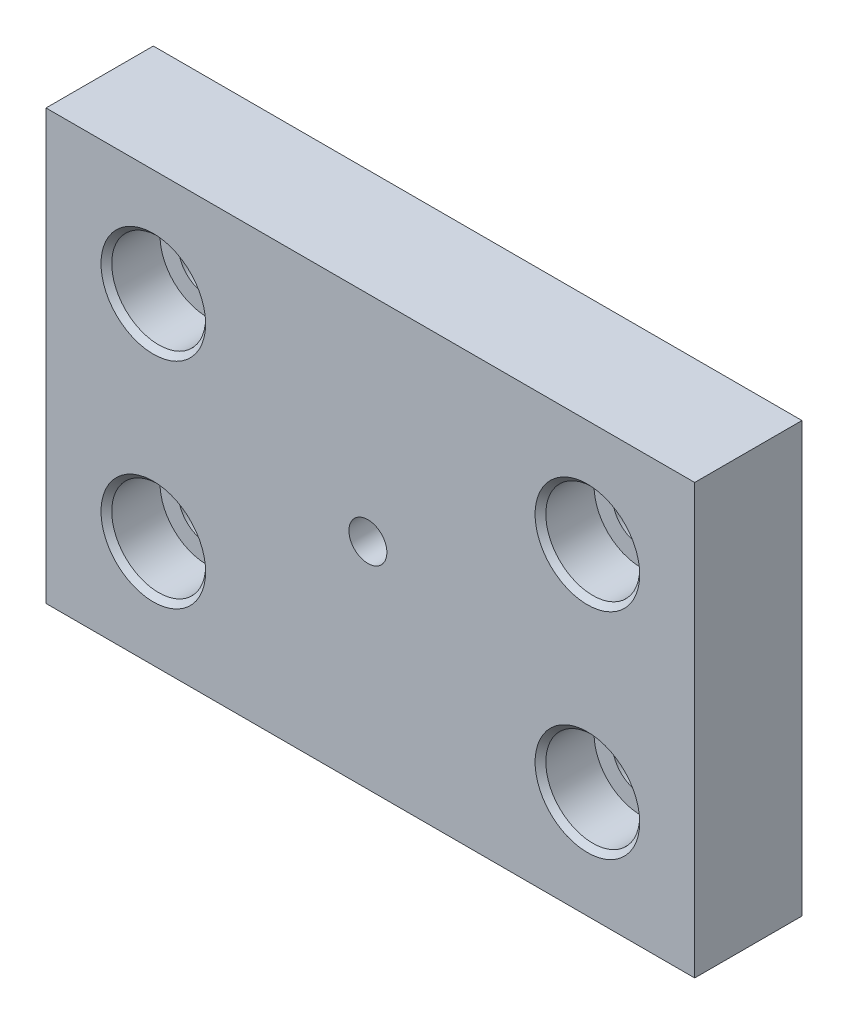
ISO-10303-21;
HEADER;
FILE_DESCRIPTION(('STEP AP214'),'2;1');
FILE_NAME('part.step','',(''),(''),'','','');
FILE_SCHEMA(('AUTOMOTIVE_DESIGN { 1 0 10303 214 1 1 1 1 }'));
ENDSEC;
DATA;
#1=APPLICATION_CONTEXT('core data for automotive mechanical design processes');
#2=APPLICATION_PROTOCOL_DEFINITION('international standard','automotive_design',2000,#1);
#3=PRODUCT_CONTEXT('',#1,'mechanical');
#4=PRODUCT('Part','Part','',(#3));
#5=PRODUCT_RELATED_PRODUCT_CATEGORY('part','',(#4));
#6=PRODUCT_DEFINITION_FORMATION('','',#4);
#7=PRODUCT_DEFINITION_CONTEXT('part definition',#1,'design');
#8=PRODUCT_DEFINITION('design','',#6,#7);
#9=PRODUCT_DEFINITION_SHAPE('','',#8);
#10=(LENGTH_UNIT() NAMED_UNIT(*) SI_UNIT(.MILLI.,.METRE.));
#11=(NAMED_UNIT(*) PLANE_ANGLE_UNIT() SI_UNIT($,.RADIAN.));
#12=(NAMED_UNIT(*) SI_UNIT($,.STERADIAN.) SOLID_ANGLE_UNIT());
#13=UNCERTAINTY_MEASURE_WITH_UNIT(LENGTH_MEASURE(1.E-05),#10,'distance_accuracy_value','');
#14=(GEOMETRIC_REPRESENTATION_CONTEXT(3) GLOBAL_UNCERTAINTY_ASSIGNED_CONTEXT((#13)) GLOBAL_UNIT_ASSIGNED_CONTEXT((#10,
#11,#12)) REPRESENTATION_CONTEXT('',''));
#15=CARTESIAN_POINT('',(0.,0.,0.));
#16=DIRECTION('',(0.,0.,1.));
#17=DIRECTION('',(1.,0.,0.));
#18=AXIS2_PLACEMENT_3D('',#15,#16,#17);
#19=CARTESIAN_POINT('',(-57.2202583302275,29.3904054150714,12.7));
#20=DIRECTION('',(1.,0.,0.));
#21=DIRECTION('',(0.,1.,0.));
#22=AXIS2_PLACEMENT_3D('',#19,#20,#21);
#23=PLANE('',#22);
#24=DIRECTION('',(0.,-1.,0.));
#25=VECTOR('',#24,1.);
#26=CARTESIAN_POINT('',(-57.2202583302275,29.3904054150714,0.));
#27=LINE('',#26,#25);
#28=CARTESIAN_POINT('',(-57.2202583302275,29.3904054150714,0.));
#29=VERTEX_POINT('',#28);
#30=CARTESIAN_POINT('',(-57.2202583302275,-21.4095945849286,0.));
#31=VERTEX_POINT('',#30);
#32=EDGE_CURVE('E109',#29,#31,#27,.T.);
#33=ORIENTED_EDGE('',*,*,#32,.T.);
#34=DIRECTION('',(0.,0.,-1.));
#35=VECTOR('',#34,1.);
#36=CARTESIAN_POINT('',(-57.2202583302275,-21.4095945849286,12.7));
#37=LINE('',#36,#35);
#38=CARTESIAN_POINT('',(-57.2202583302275,-21.4095945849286,12.7));
#39=VERTEX_POINT('',#38);
#40=EDGE_CURVE('E11',#39,#31,#37,.T.);
#41=ORIENTED_EDGE('',*,*,#40,.F.);
#42=DIRECTION('',(0.,-1.,0.));
#43=VECTOR('',#42,1.);
#44=CARTESIAN_POINT('',(-57.2202583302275,29.3904054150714,12.7));
#45=LINE('',#44,#43);
#46=CARTESIAN_POINT('',(-57.2202583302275,29.3904054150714,12.7));
#47=VERTEX_POINT('',#46);
#48=EDGE_CURVE('E92',#47,#39,#45,.T.);
#49=ORIENTED_EDGE('',*,*,#48,.F.);
#50=DIRECTION('',(0.,0.,-1.));
#51=VECTOR('',#50,1.);
#52=CARTESIAN_POINT('',(-57.2202583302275,29.3904054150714,12.7));
#53=LINE('',#52,#51);
#54=EDGE_CURVE('E105',#47,#29,#53,.T.);
#55=ORIENTED_EDGE('',*,*,#54,.T.);
#56=EDGE_LOOP('',(#33,#41,#49,#55));
#57=FACE_BOUND('',#56,.T.);
#58=ADVANCED_FACE('F40',(#57),#23,.F.);
#59=CARTESIAN_POINT('',(-57.2202583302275,-21.4095945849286,12.7));
#60=DIRECTION('',(0.,1.,0.));
#61=DIRECTION('',(0.,0.,1.));
#62=AXIS2_PLACEMENT_3D('',#59,#60,#61);
#63=PLANE('',#62);
#64=DIRECTION('',(1.,0.,0.));
#65=VECTOR('',#64,1.);
#66=CARTESIAN_POINT('',(-57.2202583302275,-21.4095945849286,0.));
#67=LINE('',#66,#65);
#68=CARTESIAN_POINT('',(19.5629091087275,-21.4095945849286,0.));
#69=VERTEX_POINT('',#68);
#70=EDGE_CURVE('E97',#31,#69,#67,.T.);
#71=ORIENTED_EDGE('',*,*,#70,.T.);
#72=DIRECTION('',(0.,0.,-1.));
#73=VECTOR('',#72,1.);
#74=CARTESIAN_POINT('',(19.5629091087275,-21.4095945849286,12.7));
#75=LINE('',#74,#73);
#76=CARTESIAN_POINT('',(19.5629091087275,-21.4095945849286,12.7));
#77=VERTEX_POINT('',#76);
#78=EDGE_CURVE('E49',#77,#69,#75,.T.);
#79=ORIENTED_EDGE('',*,*,#78,.F.);
#80=DIRECTION('',(1.,0.,0.));
#81=VECTOR('',#80,1.);
#82=CARTESIAN_POINT('',(-57.2202583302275,-21.4095945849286,12.7));
#83=LINE('',#82,#81);
#84=EDGE_CURVE('E87',#39,#77,#83,.T.);
#85=ORIENTED_EDGE('',*,*,#84,.F.);
#86=ORIENTED_EDGE('',*,*,#40,.T.);
#87=EDGE_LOOP('',(#71,#79,#85,#86));
#88=FACE_BOUND('',#87,.T.);
#89=ADVANCED_FACE('F96',(#88),#63,.F.);
#90=CARTESIAN_POINT('',(19.5629091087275,29.3904054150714,12.7));
#91=DIRECTION('',(-1.,0.,0.));
#92=DIRECTION('',(0.,-1.,0.));
#93=AXIS2_PLACEMENT_3D('',#90,#91,#92);
#94=PLANE('',#93);
#95=DIRECTION('',(0.,1.,0.));
#96=VECTOR('',#95,1.);
#97=CARTESIAN_POINT('',(19.5629091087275,29.3904054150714,0.));
#98=LINE('',#97,#96);
#99=CARTESIAN_POINT('',(19.5629091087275,29.3904054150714,0.));
#100=VERTEX_POINT('',#99);
#101=EDGE_CURVE('E74',#69,#100,#98,.T.);
#102=ORIENTED_EDGE('',*,*,#101,.T.);
#103=DIRECTION('',(0.,0.,-1.));
#104=VECTOR('',#103,1.);
#105=CARTESIAN_POINT('',(19.5629091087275,29.3904054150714,12.7));
#106=LINE('',#105,#104);
#107=CARTESIAN_POINT('',(19.5629091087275,29.3904054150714,12.7));
#108=VERTEX_POINT('',#107);
#109=EDGE_CURVE('E99',#108,#100,#106,.T.);
#110=ORIENTED_EDGE('',*,*,#109,.F.);
#111=DIRECTION('',(0.,1.,0.));
#112=VECTOR('',#111,1.);
#113=CARTESIAN_POINT('',(19.5629091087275,29.3904054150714,12.7));
#114=LINE('',#113,#112);
#115=EDGE_CURVE('E90',#77,#108,#114,.T.);
#116=ORIENTED_EDGE('',*,*,#115,.F.);
#117=ORIENTED_EDGE('',*,*,#78,.T.);
#118=EDGE_LOOP('',(#102,#110,#116,#117));
#119=FACE_BOUND('',#118,.T.);
#120=ADVANCED_FACE('F100',(#119),#94,.F.);
#121=CARTESIAN_POINT('',(-57.2202583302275,29.3904054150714,12.7));
#122=DIRECTION('',(0.,-1.,0.));
#123=DIRECTION('',(0.,0.,-1.));
#124=AXIS2_PLACEMENT_3D('',#121,#122,#123);
#125=PLANE('',#124);
#126=DIRECTION('',(-1.,0.,0.));
#127=VECTOR('',#126,1.);
#128=CARTESIAN_POINT('',(-57.2202583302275,29.3904054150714,0.));
#129=LINE('',#128,#127);
#130=EDGE_CURVE('E80',#100,#29,#129,.T.);
#131=ORIENTED_EDGE('',*,*,#130,.T.);
#132=ORIENTED_EDGE('',*,*,#54,.F.);
#133=DIRECTION('',(-1.,0.,0.));
#134=VECTOR('',#133,1.);
#135=CARTESIAN_POINT('',(-57.2202583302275,29.3904054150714,12.7));
#136=LINE('',#135,#134);
#137=EDGE_CURVE('E57',#108,#47,#136,.T.);
#138=ORIENTED_EDGE('',*,*,#137,.F.);
#139=ORIENTED_EDGE('',*,*,#109,.T.);
#140=EDGE_LOOP('',(#131,#132,#138,#139));
#141=FACE_BOUND('',#140,.T.);
#142=ADVANCED_FACE('F124',(#141),#125,.F.);
#143=CARTESIAN_POINT('',(0.,0.,12.7));
#144=DIRECTION('',(0.,0.,1.));
#145=DIRECTION('',(1.,0.,0.));
#146=AXIS2_PLACEMENT_3D('',#143,#144,#145);
#147=PLANE('',#146);
#148=CARTESIAN_POINT('',(-19.1202583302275,3.9904054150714,12.7));
#149=DIRECTION('',(0.,0.,-1.));
#150=DIRECTION('',(-1.,0.,0.));
#151=AXIS2_PLACEMENT_3D('',#148,#149,#150);
#152=CIRCLE('',#151,2.2479);
#153=CARTESIAN_POINT('',(-21.3681583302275,3.9904054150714,12.7));
#154=VERTEX_POINT('',#153);
#155=EDGE_CURVE('E211',#154,#154,#152,.T.);
#156=ORIENTED_EDGE('',*,*,#155,.T.);
#157=EDGE_LOOP('',(#156));
#158=FACE_BOUND('',#157,.T.);
#159=CARTESIAN_POINT('',(-44.5202583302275,16.6904054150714,12.7));
#160=DIRECTION('',(0.,0.,1.));
#161=DIRECTION('',(1.,0.,0.));
#162=AXIS2_PLACEMENT_3D('',#159,#160,#161);
#163=CIRCLE('',#162,6.19125);
#164=CARTESIAN_POINT('',(-38.3290083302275,16.6904054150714,12.7));
#165=VERTEX_POINT('',#164);
#166=EDGE_CURVE('E207',#165,#165,#163,.T.);
#167=ORIENTED_EDGE('',*,*,#166,.F.);
#168=EDGE_LOOP('',(#167));
#169=FACE_BOUND('',#168,.T.);
#170=CARTESIAN_POINT('',(6.86290910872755,16.6904054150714,12.7));
#171=DIRECTION('',(0.,0.,1.));
#172=DIRECTION('',(1.,0.,0.));
#173=AXIS2_PLACEMENT_3D('',#170,#171,#172);
#174=CIRCLE('',#173,6.19125);
#175=CARTESIAN_POINT('',(13.0541591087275,16.6904054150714,12.7));
#176=VERTEX_POINT('',#175);
#177=EDGE_CURVE('E187',#176,#176,#174,.T.);
#178=ORIENTED_EDGE('',*,*,#177,.F.);
#179=EDGE_LOOP('',(#178));
#180=FACE_BOUND('',#179,.T.);
#181=CARTESIAN_POINT('',(6.86290910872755,-8.7095945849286,12.7));
#182=DIRECTION('',(0.,0.,1.));
#183=DIRECTION('',(1.,0.,0.));
#184=AXIS2_PLACEMENT_3D('',#181,#182,#183);
#185=CIRCLE('',#184,6.19125);
#186=CARTESIAN_POINT('',(13.0541591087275,-8.7095945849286,12.7));
#187=VERTEX_POINT('',#186);
#188=EDGE_CURVE('E167',#187,#187,#185,.T.);
#189=ORIENTED_EDGE('',*,*,#188,.F.);
#190=EDGE_LOOP('',(#189));
#191=FACE_BOUND('',#190,.T.);
#192=CARTESIAN_POINT('',(-44.5202583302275,-8.70959458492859,12.7));
#193=DIRECTION('',(0.,0.,1.));
#194=DIRECTION('',(1.,0.,0.));
#195=AXIS2_PLACEMENT_3D('',#192,#193,#194);
#196=CIRCLE('',#195,6.19125);
#197=CARTESIAN_POINT('',(-38.3290083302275,-8.70959458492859,12.7));
#198=VERTEX_POINT('',#197);
#199=EDGE_CURVE('E147',#198,#198,#196,.T.);
#200=ORIENTED_EDGE('',*,*,#199,.F.);
#201=EDGE_LOOP('',(#200));
#202=FACE_BOUND('',#201,.T.);
#203=ORIENTED_EDGE('',*,*,#48,.T.);
#204=ORIENTED_EDGE('',*,*,#84,.T.);
#205=ORIENTED_EDGE('',*,*,#115,.T.);
#206=ORIENTED_EDGE('',*,*,#137,.T.);
#207=EDGE_LOOP('',(#203,#204,#205,#206));
#208=FACE_BOUND('',#207,.T.);
#209=ADVANCED_FACE('F88',(#158,#169,#180,#191,#202,#208),#147,.T.);
#210=CARTESIAN_POINT('',(0.,0.,0.));
#211=DIRECTION('',(0.,0.,1.));
#212=DIRECTION('',(1.,0.,0.));
#213=AXIS2_PLACEMENT_3D('',#210,#211,#212);
#214=PLANE('',#213);
#215=CARTESIAN_POINT('',(-19.1202583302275,3.9904054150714,0.));
#216=DIRECTION('',(0.,0.,-1.));
#217=DIRECTION('',(-1.,0.,0.));
#218=AXIS2_PLACEMENT_3D('',#215,#216,#217);
#219=CIRCLE('',#218,4.60375);
#220=CARTESIAN_POINT('',(-23.7240083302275,3.9904054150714,0.));
#221=VERTEX_POINT('',#220);
#222=EDGE_CURVE('E227',#221,#221,#219,.T.);
#223=ORIENTED_EDGE('',*,*,#222,.F.);
#224=EDGE_LOOP('',(#223));
#225=FACE_BOUND('',#224,.T.);
#226=CARTESIAN_POINT('',(-44.5202583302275,16.6904054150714,0.));
#227=DIRECTION('',(0.,0.,1.));
#228=DIRECTION('',(1.,0.,0.));
#229=AXIS2_PLACEMENT_3D('',#226,#227,#228);
#230=CIRCLE('',#229,3.3782);
#231=CARTESIAN_POINT('',(-41.1420583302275,16.6904054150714,0.));
#232=VERTEX_POINT('',#231);
#233=EDGE_CURVE('E191',#232,#232,#230,.T.);
#234=ORIENTED_EDGE('',*,*,#233,.T.);
#235=EDGE_LOOP('',(#234));
#236=FACE_BOUND('',#235,.T.);
#237=CARTESIAN_POINT('',(6.86290910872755,16.6904054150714,0.));
#238=DIRECTION('',(0.,0.,1.));
#239=DIRECTION('',(1.,0.,0.));
#240=AXIS2_PLACEMENT_3D('',#237,#238,#239);
#241=CIRCLE('',#240,3.3782);
#242=CARTESIAN_POINT('',(10.2411091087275,16.6904054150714,0.));
#243=VERTEX_POINT('',#242);
#244=EDGE_CURVE('E171',#243,#243,#241,.T.);
#245=ORIENTED_EDGE('',*,*,#244,.T.);
#246=EDGE_LOOP('',(#245));
#247=FACE_BOUND('',#246,.T.);
#248=CARTESIAN_POINT('',(6.86290910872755,-8.7095945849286,0.));
#249=DIRECTION('',(0.,0.,1.));
#250=DIRECTION('',(1.,0.,0.));
#251=AXIS2_PLACEMENT_3D('',#248,#249,#250);
#252=CIRCLE('',#251,3.3782);
#253=CARTESIAN_POINT('',(10.2411091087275,-8.7095945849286,0.));
#254=VERTEX_POINT('',#253);
#255=EDGE_CURVE('E151',#254,#254,#252,.T.);
#256=ORIENTED_EDGE('',*,*,#255,.T.);
#257=EDGE_LOOP('',(#256));
#258=FACE_BOUND('',#257,.T.);
#259=CARTESIAN_POINT('',(-44.5202583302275,-8.70959458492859,0.));
#260=DIRECTION('',(0.,0.,1.));
#261=DIRECTION('',(1.,0.,0.));
#262=AXIS2_PLACEMENT_3D('',#259,#260,#261);
#263=CIRCLE('',#262,3.3782);
#264=CARTESIAN_POINT('',(-41.1420583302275,-8.70959458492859,0.));
#265=VERTEX_POINT('',#264);
#266=EDGE_CURVE('E113',#265,#265,#263,.T.);
#267=ORIENTED_EDGE('',*,*,#266,.T.);
#268=EDGE_LOOP('',(#267));
#269=FACE_BOUND('',#268,.T.);
#270=ORIENTED_EDGE('',*,*,#32,.F.);
#271=ORIENTED_EDGE('',*,*,#130,.F.);
#272=ORIENTED_EDGE('',*,*,#101,.F.);
#273=ORIENTED_EDGE('',*,*,#70,.F.);
#274=EDGE_LOOP('',(#270,#271,#272,#273));
#275=FACE_BOUND('',#274,.T.);
#276=ADVANCED_FACE('F127',(#225,#236,#247,#258,#269,#275),#214,.F.);
#277=CARTESIAN_POINT('',(-44.5202583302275,-8.70959458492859,12.7));
#278=DIRECTION('',(0.,0.,1.));
#279=DIRECTION('',(1.,0.,0.));
#280=AXIS2_PLACEMENT_3D('',#277,#278,#279);
#281=CYLINDRICAL_SURFACE('',#280,3.3782);
#282=ORIENTED_EDGE('',*,*,#266,.F.);
#283=EDGE_LOOP('',(#282));
#284=FACE_BOUND('',#283,.T.);
#285=CARTESIAN_POINT('',(-44.5202583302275,-8.70959458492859,6.35));
#286=DIRECTION('',(0.,0.,1.));
#287=DIRECTION('',(1.,0.,0.));
#288=AXIS2_PLACEMENT_3D('',#285,#286,#287);
#289=CIRCLE('',#288,3.3782);
#290=CARTESIAN_POINT('',(-41.1420583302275,-8.70959458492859,6.35));
#291=VERTEX_POINT('',#290);
#292=EDGE_CURVE('E135',#291,#291,#289,.T.);
#293=ORIENTED_EDGE('',*,*,#292,.T.);
#294=EDGE_LOOP('',(#293));
#295=FACE_BOUND('',#294,.T.);
#296=ADVANCED_FACE('F237',(#284,#295),#281,.F.);
#297=CARTESIAN_POINT('',(-38.9640083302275,-8.70959458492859,6.35));
#298=DIRECTION('',(0.,0.,-1.));
#299=DIRECTION('',(-1.,0.,0.));
#300=AXIS2_PLACEMENT_3D('',#297,#298,#299);
#301=PLANE('',#300);
#302=ORIENTED_EDGE('',*,*,#292,.F.);
#303=EDGE_LOOP('',(#302));
#304=FACE_BOUND('',#303,.T.);
#305=CARTESIAN_POINT('',(-44.5202583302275,-8.70959458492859,6.35));
#306=DIRECTION('',(0.,0.,1.));
#307=DIRECTION('',(1.,0.,0.));
#308=AXIS2_PLACEMENT_3D('',#305,#306,#307);
#309=CIRCLE('',#308,5.55625);
#310=CARTESIAN_POINT('',(-38.9640083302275,-8.70959458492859,6.35));
#311=VERTEX_POINT('',#310);
#312=EDGE_CURVE('E139',#311,#311,#309,.T.);
#313=ORIENTED_EDGE('',*,*,#312,.T.);
#314=EDGE_LOOP('',(#313));
#315=FACE_BOUND('',#314,.T.);
#316=ADVANCED_FACE('F249',(#304,#315),#301,.F.);
#317=CARTESIAN_POINT('',(-44.5202583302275,-8.70959458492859,12.7));
#318=DIRECTION('',(0.,0.,1.));
#319=DIRECTION('',(1.,0.,0.));
#320=AXIS2_PLACEMENT_3D('',#317,#318,#319);
#321=CYLINDRICAL_SURFACE('',#320,5.55625);
#322=ORIENTED_EDGE('',*,*,#312,.F.);
#323=EDGE_LOOP('',(#322));
#324=FACE_BOUND('',#323,.T.);
#325=CARTESIAN_POINT('',(-44.5202583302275,-8.70959458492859,12.065));
#326=DIRECTION('',(0.,0.,1.));
#327=DIRECTION('',(1.,0.,0.));
#328=AXIS2_PLACEMENT_3D('',#325,#326,#327);
#329=CIRCLE('',#328,5.55625);
#330=CARTESIAN_POINT('',(-38.9640083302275,-8.70959458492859,12.065));
#331=VERTEX_POINT('',#330);
#332=EDGE_CURVE('E143',#331,#331,#329,.T.);
#333=ORIENTED_EDGE('',*,*,#332,.T.);
#334=EDGE_LOOP('',(#333));
#335=FACE_BOUND('',#334,.T.);
#336=ADVANCED_FACE('F255',(#324,#335),#321,.F.);
#337=CARTESIAN_POINT('',(-44.5202583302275,-8.70959458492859,12.7));
#338=DIRECTION('',(0.,0.,1.));
#339=DIRECTION('',(1.,0.,0.));
#340=AXIS2_PLACEMENT_3D('',#337,#338,#339);
#341=CONICAL_SURFACE('',#340,6.19125,0.785398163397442);
#342=ORIENTED_EDGE('',*,*,#332,.F.);
#343=EDGE_LOOP('',(#342));
#344=FACE_BOUND('',#343,.T.);
#345=ORIENTED_EDGE('',*,*,#199,.T.);
#346=EDGE_LOOP('',(#345));
#347=FACE_BOUND('',#346,.T.);
#348=ADVANCED_FACE('F261',(#344,#347),#341,.F.);
#349=CARTESIAN_POINT('',(6.86290910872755,-8.7095945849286,12.7));
#350=DIRECTION('',(0.,0.,1.));
#351=DIRECTION('',(1.,0.,0.));
#352=AXIS2_PLACEMENT_3D('',#349,#350,#351);
#353=CYLINDRICAL_SURFACE('',#352,3.3782);
#354=ORIENTED_EDGE('',*,*,#255,.F.);
#355=EDGE_LOOP('',(#354));
#356=FACE_BOUND('',#355,.T.);
#357=CARTESIAN_POINT('',(6.86290910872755,-8.7095945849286,6.35));
#358=DIRECTION('',(0.,0.,1.));
#359=DIRECTION('',(1.,0.,0.));
#360=AXIS2_PLACEMENT_3D('',#357,#358,#359);
#361=CIRCLE('',#360,3.3782);
#362=CARTESIAN_POINT('',(10.2411091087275,-8.7095945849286,6.35));
#363=VERTEX_POINT('',#362);
#364=EDGE_CURVE('E155',#363,#363,#361,.T.);
#365=ORIENTED_EDGE('',*,*,#364,.T.);
#366=EDGE_LOOP('',(#365));
#367=FACE_BOUND('',#366,.T.);
#368=ADVANCED_FACE('F267',(#356,#367),#353,.F.);
#369=CARTESIAN_POINT('',(12.4191591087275,-8.7095945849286,6.35));
#370=DIRECTION('',(0.,0.,-1.));
#371=DIRECTION('',(-1.,0.,0.));
#372=AXIS2_PLACEMENT_3D('',#369,#370,#371);
#373=PLANE('',#372);
#374=ORIENTED_EDGE('',*,*,#364,.F.);
#375=EDGE_LOOP('',(#374));
#376=FACE_BOUND('',#375,.T.);
#377=CARTESIAN_POINT('',(6.86290910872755,-8.7095945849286,6.35));
#378=DIRECTION('',(0.,0.,1.));
#379=DIRECTION('',(1.,0.,0.));
#380=AXIS2_PLACEMENT_3D('',#377,#378,#379);
#381=CIRCLE('',#380,5.55625);
#382=CARTESIAN_POINT('',(12.4191591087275,-8.7095945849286,6.35));
#383=VERTEX_POINT('',#382);
#384=EDGE_CURVE('E159',#383,#383,#381,.T.);
#385=ORIENTED_EDGE('',*,*,#384,.T.);
#386=EDGE_LOOP('',(#385));
#387=FACE_BOUND('',#386,.T.);
#388=ADVANCED_FACE('F338',(#376,#387),#373,.F.);
#389=CARTESIAN_POINT('',(6.86290910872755,-8.7095945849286,12.7));
#390=DIRECTION('',(0.,0.,1.));
#391=DIRECTION('',(1.,0.,0.));
#392=AXIS2_PLACEMENT_3D('',#389,#390,#391);
#393=CYLINDRICAL_SURFACE('',#392,5.55625);
#394=ORIENTED_EDGE('',*,*,#384,.F.);
#395=EDGE_LOOP('',(#394));
#396=FACE_BOUND('',#395,.T.);
#397=CARTESIAN_POINT('',(6.86290910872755,-8.7095945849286,12.065));
#398=DIRECTION('',(0.,0.,1.));
#399=DIRECTION('',(1.,0.,0.));
#400=AXIS2_PLACEMENT_3D('',#397,#398,#399);
#401=CIRCLE('',#400,5.55625);
#402=CARTESIAN_POINT('',(12.4191591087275,-8.7095945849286,12.065));
#403=VERTEX_POINT('',#402);
#404=EDGE_CURVE('E163',#403,#403,#401,.T.);
#405=ORIENTED_EDGE('',*,*,#404,.T.);
#406=EDGE_LOOP('',(#405));
#407=FACE_BOUND('',#406,.T.);
#408=ADVANCED_FACE('F348',(#396,#407),#393,.F.);
#409=CARTESIAN_POINT('',(6.86290910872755,-8.7095945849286,12.7));
#410=DIRECTION('',(0.,0.,1.));
#411=DIRECTION('',(1.,0.,0.));
#412=AXIS2_PLACEMENT_3D('',#409,#410,#411);
#413=CONICAL_SURFACE('',#412,6.19125,0.785398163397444);
#414=ORIENTED_EDGE('',*,*,#404,.F.);
#415=EDGE_LOOP('',(#414));
#416=FACE_BOUND('',#415,.T.);
#417=ORIENTED_EDGE('',*,*,#188,.T.);
#418=EDGE_LOOP('',(#417));
#419=FACE_BOUND('',#418,.T.);
#420=ADVANCED_FACE('F358',(#416,#419),#413,.F.);
#421=CARTESIAN_POINT('',(6.86290910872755,16.6904054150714,12.7));
#422=DIRECTION('',(0.,0.,1.));
#423=DIRECTION('',(1.,0.,0.));
#424=AXIS2_PLACEMENT_3D('',#421,#422,#423);
#425=CYLINDRICAL_SURFACE('',#424,3.3782);
#426=ORIENTED_EDGE('',*,*,#244,.F.);
#427=EDGE_LOOP('',(#426));
#428=FACE_BOUND('',#427,.T.);
#429=CARTESIAN_POINT('',(6.86290910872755,16.6904054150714,6.35));
#430=DIRECTION('',(0.,0.,1.));
#431=DIRECTION('',(1.,0.,0.));
#432=AXIS2_PLACEMENT_3D('',#429,#430,#431);
#433=CIRCLE('',#432,3.3782);
#434=CARTESIAN_POINT('',(10.2411091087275,16.6904054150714,6.35));
#435=VERTEX_POINT('',#434);
#436=EDGE_CURVE('E175',#435,#435,#433,.T.);
#437=ORIENTED_EDGE('',*,*,#436,.T.);
#438=EDGE_LOOP('',(#437));
#439=FACE_BOUND('',#438,.T.);
#440=ADVANCED_FACE('F368',(#428,#439),#425,.F.);
#441=CARTESIAN_POINT('',(12.4191591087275,16.6904054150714,6.35));
#442=DIRECTION('',(0.,0.,-1.));
#443=DIRECTION('',(-1.,0.,0.));
#444=AXIS2_PLACEMENT_3D('',#441,#442,#443);
#445=PLANE('',#444);
#446=ORIENTED_EDGE('',*,*,#436,.F.);
#447=EDGE_LOOP('',(#446));
#448=FACE_BOUND('',#447,.T.);
#449=CARTESIAN_POINT('',(6.86290910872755,16.6904054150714,6.35));
#450=DIRECTION('',(0.,0.,1.));
#451=DIRECTION('',(1.,0.,0.));
#452=AXIS2_PLACEMENT_3D('',#449,#450,#451);
#453=CIRCLE('',#452,5.55625);
#454=CARTESIAN_POINT('',(12.4191591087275,16.6904054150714,6.35));
#455=VERTEX_POINT('',#454);
#456=EDGE_CURVE('E179',#455,#455,#453,.T.);
#457=ORIENTED_EDGE('',*,*,#456,.T.);
#458=EDGE_LOOP('',(#457));
#459=FACE_BOUND('',#458,.T.);
#460=ADVANCED_FACE('F378',(#448,#459),#445,.F.);
#461=CARTESIAN_POINT('',(6.86290910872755,16.6904054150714,12.7));
#462=DIRECTION('',(0.,0.,1.));
#463=DIRECTION('',(1.,0.,0.));
#464=AXIS2_PLACEMENT_3D('',#461,#462,#463);
#465=CYLINDRICAL_SURFACE('',#464,5.55625);
#466=ORIENTED_EDGE('',*,*,#456,.F.);
#467=EDGE_LOOP('',(#466));
#468=FACE_BOUND('',#467,.T.);
#469=CARTESIAN_POINT('',(6.86290910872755,16.6904054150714,12.065));
#470=DIRECTION('',(0.,0.,1.));
#471=DIRECTION('',(1.,0.,0.));
#472=AXIS2_PLACEMENT_3D('',#469,#470,#471);
#473=CIRCLE('',#472,5.55625);
#474=CARTESIAN_POINT('',(12.4191591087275,16.6904054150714,12.065));
#475=VERTEX_POINT('',#474);
#476=EDGE_CURVE('E183',#475,#475,#473,.T.);
#477=ORIENTED_EDGE('',*,*,#476,.T.);
#478=EDGE_LOOP('',(#477));
#479=FACE_BOUND('',#478,.T.);
#480=ADVANCED_FACE('F388',(#468,#479),#465,.F.);
#481=CARTESIAN_POINT('',(6.86290910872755,16.6904054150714,12.7));
#482=DIRECTION('',(0.,0.,1.));
#483=DIRECTION('',(1.,0.,0.));
#484=AXIS2_PLACEMENT_3D('',#481,#482,#483);
#485=CONICAL_SURFACE('',#484,6.19125,0.785398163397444);
#486=ORIENTED_EDGE('',*,*,#476,.F.);
#487=EDGE_LOOP('',(#486));
#488=FACE_BOUND('',#487,.T.);
#489=ORIENTED_EDGE('',*,*,#177,.T.);
#490=EDGE_LOOP('',(#489));
#491=FACE_BOUND('',#490,.T.);
#492=ADVANCED_FACE('F398',(#488,#491),#485,.F.);
#493=CARTESIAN_POINT('',(-44.5202583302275,16.6904054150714,12.7));
#494=DIRECTION('',(0.,0.,1.));
#495=DIRECTION('',(1.,0.,0.));
#496=AXIS2_PLACEMENT_3D('',#493,#494,#495);
#497=CYLINDRICAL_SURFACE('',#496,3.3782);
#498=ORIENTED_EDGE('',*,*,#233,.F.);
#499=EDGE_LOOP('',(#498));
#500=FACE_BOUND('',#499,.T.);
#501=CARTESIAN_POINT('',(-44.5202583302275,16.6904054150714,6.35));
#502=DIRECTION('',(0.,0.,1.));
#503=DIRECTION('',(1.,0.,0.));
#504=AXIS2_PLACEMENT_3D('',#501,#502,#503);
#505=CIRCLE('',#504,3.3782);
#506=CARTESIAN_POINT('',(-41.1420583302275,16.6904054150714,6.35));
#507=VERTEX_POINT('',#506);
#508=EDGE_CURVE('E195',#507,#507,#505,.T.);
#509=ORIENTED_EDGE('',*,*,#508,.T.);
#510=EDGE_LOOP('',(#509));
#511=FACE_BOUND('',#510,.T.);
#512=ADVANCED_FACE('F408',(#500,#511),#497,.F.);
#513=CARTESIAN_POINT('',(-38.9640083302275,16.6904054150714,6.35));
#514=DIRECTION('',(0.,0.,-1.));
#515=DIRECTION('',(-1.,0.,0.));
#516=AXIS2_PLACEMENT_3D('',#513,#514,#515);
#517=PLANE('',#516);
#518=ORIENTED_EDGE('',*,*,#508,.F.);
#519=EDGE_LOOP('',(#518));
#520=FACE_BOUND('',#519,.T.);
#521=CARTESIAN_POINT('',(-44.5202583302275,16.6904054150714,6.35));
#522=DIRECTION('',(0.,0.,1.));
#523=DIRECTION('',(1.,0.,0.));
#524=AXIS2_PLACEMENT_3D('',#521,#522,#523);
#525=CIRCLE('',#524,5.55625);
#526=CARTESIAN_POINT('',(-38.9640083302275,16.6904054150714,6.35));
#527=VERTEX_POINT('',#526);
#528=EDGE_CURVE('E199',#527,#527,#525,.T.);
#529=ORIENTED_EDGE('',*,*,#528,.T.);
#530=EDGE_LOOP('',(#529));
#531=FACE_BOUND('',#530,.T.);
#532=ADVANCED_FACE('F418',(#520,#531),#517,.F.);
#533=CARTESIAN_POINT('',(-44.5202583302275,16.6904054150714,12.7));
#534=DIRECTION('',(0.,0.,1.));
#535=DIRECTION('',(1.,0.,0.));
#536=AXIS2_PLACEMENT_3D('',#533,#534,#535);
#537=CYLINDRICAL_SURFACE('',#536,5.55625);
#538=ORIENTED_EDGE('',*,*,#528,.F.);
#539=EDGE_LOOP('',(#538));
#540=FACE_BOUND('',#539,.T.);
#541=CARTESIAN_POINT('',(-44.5202583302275,16.6904054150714,12.065));
#542=DIRECTION('',(0.,0.,1.));
#543=DIRECTION('',(1.,0.,0.));
#544=AXIS2_PLACEMENT_3D('',#541,#542,#543);
#545=CIRCLE('',#544,5.55625);
#546=CARTESIAN_POINT('',(-38.9640083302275,16.6904054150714,12.065));
#547=VERTEX_POINT('',#546);
#548=EDGE_CURVE('E203',#547,#547,#545,.T.);
#549=ORIENTED_EDGE('',*,*,#548,.T.);
#550=EDGE_LOOP('',(#549));
#551=FACE_BOUND('',#550,.T.);
#552=ADVANCED_FACE('F428',(#540,#551),#537,.F.);
#553=CARTESIAN_POINT('',(-44.5202583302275,16.6904054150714,12.7));
#554=DIRECTION('',(0.,0.,1.));
#555=DIRECTION('',(1.,0.,0.));
#556=AXIS2_PLACEMENT_3D('',#553,#554,#555);
#557=CONICAL_SURFACE('',#556,6.19125,0.785398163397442);
#558=ORIENTED_EDGE('',*,*,#548,.F.);
#559=EDGE_LOOP('',(#558));
#560=FACE_BOUND('',#559,.T.);
#561=ORIENTED_EDGE('',*,*,#166,.T.);
#562=EDGE_LOOP('',(#561));
#563=FACE_BOUND('',#562,.T.);
#564=ADVANCED_FACE('F438',(#560,#563),#557,.F.);
#565=CARTESIAN_POINT('',(-19.1202583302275,3.9904054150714,0.));
#566=DIRECTION('',(0.,0.,-1.));
#567=DIRECTION('',(-1.,0.,0.));
#568=AXIS2_PLACEMENT_3D('',#565,#566,#567);
#569=CYLINDRICAL_SURFACE('',#568,2.2479);
#570=ORIENTED_EDGE('',*,*,#155,.F.);
#571=EDGE_LOOP('',(#570));
#572=FACE_BOUND('',#571,.T.);
#573=CARTESIAN_POINT('',(-19.1202583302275,3.9904054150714,4.1656));
#574=DIRECTION('',(0.,0.,-1.));
#575=DIRECTION('',(-1.,0.,0.));
#576=AXIS2_PLACEMENT_3D('',#573,#574,#575);
#577=CIRCLE('',#576,2.2479);
#578=CARTESIAN_POINT('',(-21.3681583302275,3.9904054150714,4.1656));
#579=VERTEX_POINT('',#578);
#580=EDGE_CURVE('E215',#579,#579,#577,.T.);
#581=ORIENTED_EDGE('',*,*,#580,.T.);
#582=EDGE_LOOP('',(#581));
#583=FACE_BOUND('',#582,.T.);
#584=ADVANCED_FACE('F447',(#572,#583),#569,.F.);
#585=CARTESIAN_POINT('',(-15.1515083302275,3.9904054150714,4.1656));
#586=DIRECTION('',(0.,0.,1.));
#587=DIRECTION('',(1.,0.,0.));
#588=AXIS2_PLACEMENT_3D('',#585,#586,#587);
#589=PLANE('',#588);
#590=ORIENTED_EDGE('',*,*,#580,.F.);
#591=EDGE_LOOP('',(#590));
#592=FACE_BOUND('',#591,.T.);
#593=CARTESIAN_POINT('',(-19.1202583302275,3.9904054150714,4.1656));
#594=DIRECTION('',(0.,0.,-1.));
#595=DIRECTION('',(-1.,0.,0.));
#596=AXIS2_PLACEMENT_3D('',#593,#594,#595);
#597=CIRCLE('',#596,3.96875);
#598=CARTESIAN_POINT('',(-23.0890083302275,3.9904054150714,4.1656));
#599=VERTEX_POINT('',#598);
#600=EDGE_CURVE('E219',#599,#599,#597,.T.);
#601=ORIENTED_EDGE('',*,*,#600,.T.);
#602=EDGE_LOOP('',(#601));
#603=FACE_BOUND('',#602,.T.);
#604=ADVANCED_FACE('F456',(#592,#603),#589,.F.);
#605=CARTESIAN_POINT('',(-19.1202583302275,3.9904054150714,0.));
#606=DIRECTION('',(0.,0.,-1.));
#607=DIRECTION('',(-1.,0.,0.));
#608=AXIS2_PLACEMENT_3D('',#605,#606,#607);
#609=CYLINDRICAL_SURFACE('',#608,3.96875);
#610=ORIENTED_EDGE('',*,*,#600,.F.);
#611=EDGE_LOOP('',(#610));
#612=FACE_BOUND('',#611,.T.);
#613=CARTESIAN_POINT('',(-19.1202583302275,3.9904054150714,0.635));
#614=DIRECTION('',(0.,0.,-1.));
#615=DIRECTION('',(-1.,0.,0.));
#616=AXIS2_PLACEMENT_3D('',#613,#614,#615);
#617=CIRCLE('',#616,3.96875);
#618=CARTESIAN_POINT('',(-23.0890083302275,3.9904054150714,0.635));
#619=VERTEX_POINT('',#618);
#620=EDGE_CURVE('E223',#619,#619,#617,.T.);
#621=ORIENTED_EDGE('',*,*,#620,.T.);
#622=EDGE_LOOP('',(#621));
#623=FACE_BOUND('',#622,.T.);
#624=ADVANCED_FACE('F466',(#612,#623),#609,.F.);
#625=CARTESIAN_POINT('',(-19.1202583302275,3.9904054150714,0.));
#626=DIRECTION('',(0.,0.,-1.));
#627=DIRECTION('',(-1.,0.,0.));
#628=AXIS2_PLACEMENT_3D('',#625,#626,#627);
#629=CONICAL_SURFACE('',#628,4.60375,0.785398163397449);
#630=ORIENTED_EDGE('',*,*,#620,.F.);
#631=EDGE_LOOP('',(#630));
#632=FACE_BOUND('',#631,.T.);
#633=ORIENTED_EDGE('',*,*,#222,.T.);
#634=EDGE_LOOP('',(#633));
#635=FACE_BOUND('',#634,.T.);
#636=ADVANCED_FACE('F233',(#632,#635),#629,.F.);
#637=CLOSED_SHELL('',(#58,#89,#120,#142,#209,#276,#296,#316,#336,#348,#368,#388,#408,#420,#440,
#460,#480,#492,#512,#532,#552,#564,#584,#604,#624,#636));
#638=MANIFOLD_SOLID_BREP('B2',#637);
#639=ADVANCED_BREP_SHAPE_REPRESENTATION('',(#18,#638),#14);
#640=SHAPE_DEFINITION_REPRESENTATION(#9,#639);
ENDSEC;
END-ISO-10303-21;
